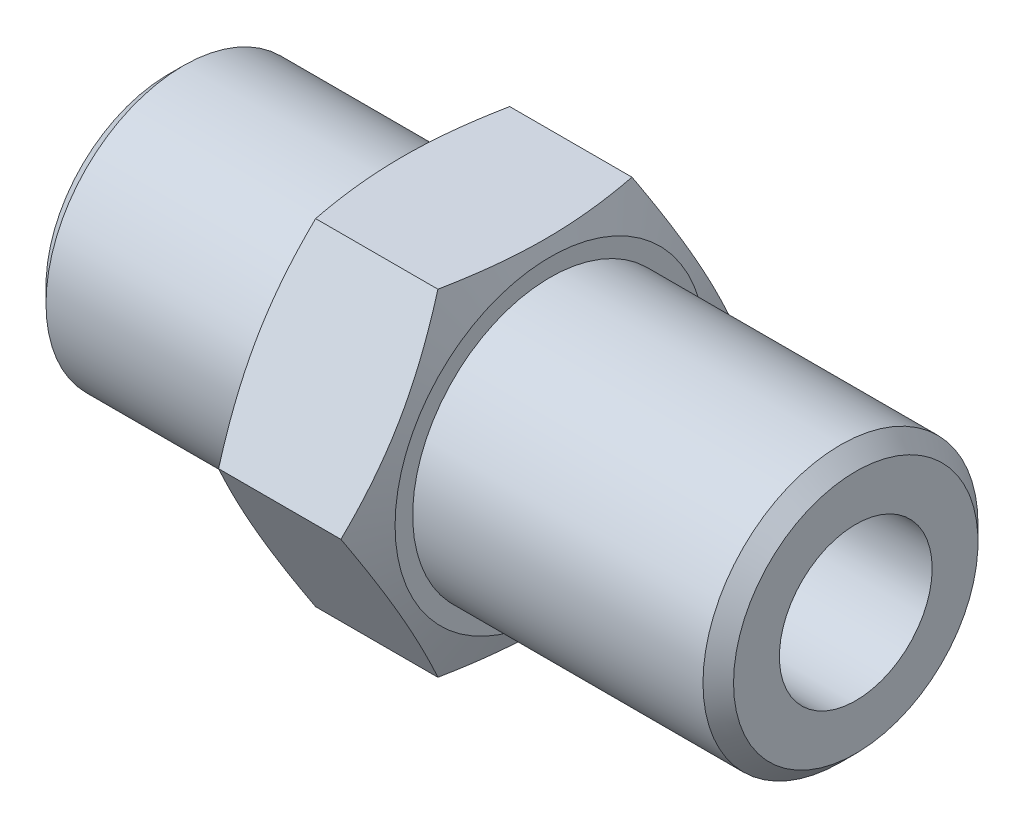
ISO-10303-21;
HEADER;
FILE_DESCRIPTION(('STEP AP214'),'2;1');
FILE_NAME('part.step','',(''),(''),'','','');
FILE_SCHEMA(('AUTOMOTIVE_DESIGN { 1 0 10303 214 1 1 1 1 }'));
ENDSEC;
DATA;
#1=APPLICATION_CONTEXT('core data for automotive mechanical design processes');
#2=APPLICATION_PROTOCOL_DEFINITION('international standard','automotive_design',2000,#1);
#3=PRODUCT_CONTEXT('',#1,'mechanical');
#4=PRODUCT('Part','Part','',(#3));
#5=PRODUCT_RELATED_PRODUCT_CATEGORY('part','',(#4));
#6=PRODUCT_DEFINITION_FORMATION('','',#4);
#7=PRODUCT_DEFINITION_CONTEXT('part definition',#1,'design');
#8=PRODUCT_DEFINITION('design','',#6,#7);
#9=PRODUCT_DEFINITION_SHAPE('','',#8);
#10=(LENGTH_UNIT() NAMED_UNIT(*) SI_UNIT(.MILLI.,.METRE.));
#11=(NAMED_UNIT(*) PLANE_ANGLE_UNIT() SI_UNIT($,.RADIAN.));
#12=(NAMED_UNIT(*) SI_UNIT($,.STERADIAN.) SOLID_ANGLE_UNIT());
#13=UNCERTAINTY_MEASURE_WITH_UNIT(LENGTH_MEASURE(1.E-05),#10,'distance_accuracy_value','');
#14=(GEOMETRIC_REPRESENTATION_CONTEXT(3) GLOBAL_UNCERTAINTY_ASSIGNED_CONTEXT((#13)) GLOBAL_UNIT_ASSIGNED_CONTEXT((#10,
#11,#12)) REPRESENTATION_CONTEXT('',''));
#15=CARTESIAN_POINT('',(0.,0.,0.));
#16=DIRECTION('',(0.,0.,1.));
#17=DIRECTION('',(1.,0.,0.));
#18=AXIS2_PLACEMENT_3D('',#15,#16,#17);
#19=CARTESIAN_POINT('',(-15.,0.,0.));
#20=DIRECTION('',(-1.,0.,0.));
#21=DIRECTION('',(0.,0.,1.));
#22=AXIS2_PLACEMENT_3D('',#19,#20,#21);
#23=PLANE('',#22);
#24=CARTESIAN_POINT('',(-15.,0.,0.));
#25=DIRECTION('',(-1.,0.,0.));
#26=DIRECTION('',(0.,0.,1.));
#27=AXIS2_PLACEMENT_3D('',#24,#25,#26);
#28=CIRCLE('',#27,5.);
#29=CARTESIAN_POINT('',(-15.,0.,5.));
#30=VERTEX_POINT('',#29);
#31=EDGE_CURVE('E19',#30,#30,#28,.F.);
#32=ORIENTED_EDGE('',*,*,#31,.T.);
#33=EDGE_LOOP('',(#32));
#34=FACE_BOUND('',#33,.T.);
#35=CARTESIAN_POINT('',(-15.,0.,0.));
#36=DIRECTION('',(1.,0.,0.));
#37=DIRECTION('',(0.,0.,-1.));
#38=AXIS2_PLACEMENT_3D('',#35,#36,#37);
#39=CIRCLE('',#38,8.);
#40=CARTESIAN_POINT('',(-15.,0.,-8.));
#41=VERTEX_POINT('',#40);
#42=EDGE_CURVE('E409',#41,#41,#39,.T.);
#43=ORIENTED_EDGE('',*,*,#42,.F.);
#44=EDGE_LOOP('',(#43));
#45=FACE_BOUND('',#44,.T.);
#46=ADVANCED_FACE('F16',(#34,#45),#23,.T.);
#47=CARTESIAN_POINT('',(0.,0.,0.));
#48=DIRECTION('',(-1.,0.,0.));
#49=DIRECTION('',(0.,0.,1.));
#50=AXIS2_PLACEMENT_3D('',#47,#48,#49);
#51=CYLINDRICAL_SURFACE('',#50,5.);
#52=ORIENTED_EDGE('',*,*,#31,.F.);
#53=EDGE_LOOP('',(#52));
#54=FACE_BOUND('',#53,.T.);
#55=CARTESIAN_POINT('',(0.,0.,0.));
#56=DIRECTION('',(-1.,0.,0.));
#57=DIRECTION('',(0.,0.,1.));
#58=AXIS2_PLACEMENT_3D('',#55,#56,#57);
#59=CIRCLE('',#58,5.);
#60=CARTESIAN_POINT('',(0.,0.,5.));
#61=VERTEX_POINT('',#60);
#62=EDGE_CURVE('E201',#61,#61,#59,.F.);
#63=ORIENTED_EDGE('',*,*,#62,.T.);
#64=EDGE_LOOP('',(#63));
#65=FACE_BOUND('',#64,.T.);
#66=ADVANCED_FACE('F381',(#54,#65),#51,.F.);
#67=CARTESIAN_POINT('',(-14.,0.,0.));
#68=DIRECTION('',(1.,0.,0.));
#69=DIRECTION('',(0.,0.,-1.));
#70=AXIS2_PLACEMENT_3D('',#67,#68,#69);
#71=CONICAL_SURFACE('',#70,9.,0.785398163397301);
#72=CARTESIAN_POINT('',(-14.,0.,0.));
#73=DIRECTION('',(-1.,0.,0.));
#74=DIRECTION('',(0.,0.,1.));
#75=AXIS2_PLACEMENT_3D('',#72,#73,#74);
#76=CIRCLE('',#75,9.);
#77=CARTESIAN_POINT('',(-14.,0.,9.));
#78=VERTEX_POINT('',#77);
#79=EDGE_CURVE('E197',#78,#78,#76,.F.);
#80=ORIENTED_EDGE('',*,*,#79,.F.);
#81=EDGE_LOOP('',(#80));
#82=FACE_BOUND('',#81,.T.);
#83=ORIENTED_EDGE('',*,*,#42,.T.);
#84=EDGE_LOOP('',(#83));
#85=FACE_BOUND('',#84,.T.);
#86=ADVANCED_FACE('F371',(#82,#85),#71,.T.);
#87=CARTESIAN_POINT('',(0.,0.,0.));
#88=DIRECTION('',(1.,0.,0.));
#89=DIRECTION('',(0.,0.,-1.));
#90=AXIS2_PLACEMENT_3D('',#87,#88,#89);
#91=PLANE('',#90);
#92=CARTESIAN_POINT('',(0.,0.,0.));
#93=DIRECTION('',(1.,0.,0.));
#94=DIRECTION('',(0.,0.,-1.));
#95=AXIS2_PLACEMENT_3D('',#92,#93,#94);
#96=CIRCLE('',#95,4.);
#97=CARTESIAN_POINT('',(0.,0.,-4.));
#98=VERTEX_POINT('',#97);
#99=EDGE_CURVE('E200',#98,#98,#96,.T.);
#100=ORIENTED_EDGE('',*,*,#99,.T.);
#101=EDGE_LOOP('',(#100));
#102=FACE_BOUND('',#101,.T.);
#103=ORIENTED_EDGE('',*,*,#62,.F.);
#104=EDGE_LOOP('',(#103));
#105=FACE_BOUND('',#104,.T.);
#106=ADVANCED_FACE('F361',(#102,#105),#91,.F.);
#107=CARTESIAN_POINT('',(0.,0.,0.));
#108=DIRECTION('',(-1.,0.,0.));
#109=DIRECTION('',(0.,0.,1.));
#110=AXIS2_PLACEMENT_3D('',#107,#108,#109);
#111=CYLINDRICAL_SURFACE('',#110,9.);
#112=ORIENTED_EDGE('',*,*,#79,.T.);
#113=EDGE_LOOP('',(#112));
#114=FACE_BOUND('',#113,.T.);
#115=CARTESIAN_POINT('',(0.,0.,0.));
#116=DIRECTION('',(-1.,0.,0.));
#117=DIRECTION('',(0.,0.,1.));
#118=AXIS2_PLACEMENT_3D('',#115,#116,#117);
#119=CIRCLE('',#118,9.);
#120=CARTESIAN_POINT('',(0.,0.,9.));
#121=VERTEX_POINT('',#120);
#122=EDGE_CURVE('E416',#121,#121,#119,.T.);
#123=ORIENTED_EDGE('',*,*,#122,.T.);
#124=EDGE_LOOP('',(#123));
#125=FACE_BOUND('',#124,.T.);
#126=ADVANCED_FACE('F351',(#114,#125),#111,.T.);
#127=CARTESIAN_POINT('',(0.,0.,0.));
#128=DIRECTION('',(1.,0.,0.));
#129=DIRECTION('',(0.,0.,-1.));
#130=AXIS2_PLACEMENT_3D('',#127,#128,#129);
#131=CYLINDRICAL_SURFACE('',#130,4.);
#132=CARTESIAN_POINT('',(10.,0.,0.));
#133=DIRECTION('',(1.,0.,0.));
#134=DIRECTION('',(0.,0.,-1.));
#135=AXIS2_PLACEMENT_3D('',#132,#133,#134);
#136=CIRCLE('',#135,4.);
#137=CARTESIAN_POINT('',(10.,0.,-4.));
#138=VERTEX_POINT('',#137);
#139=EDGE_CURVE('E419',#138,#138,#136,.F.);
#140=ORIENTED_EDGE('',*,*,#139,.F.);
#141=EDGE_LOOP('',(#140));
#142=FACE_BOUND('',#141,.T.);
#143=ORIENTED_EDGE('',*,*,#99,.F.);
#144=EDGE_LOOP('',(#143));
#145=FACE_BOUND('',#144,.T.);
#146=ADVANCED_FACE('F342',(#142,#145),#131,.F.);
#147=CARTESIAN_POINT('',(0.,0.,0.));
#148=DIRECTION('',(1.,0.,0.));
#149=DIRECTION('',(0.,0.,-1.));
#150=AXIS2_PLACEMENT_3D('',#147,#148,#149);
#151=PLANE('',#150);
#152=ORIENTED_EDGE('',*,*,#122,.F.);
#153=EDGE_LOOP('',(#152));
#154=FACE_BOUND('',#153,.T.);
#155=CARTESIAN_POINT('',(5.62700927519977E-13,0.,0.));
#156=DIRECTION('',(1.,0.,0.));
#157=DIRECTION('',(0.,0.,-1.));
#158=AXIS2_PLACEMENT_3D('',#155,#156,#157);
#159=CIRCLE('',#158,10.1536396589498);
#160=CARTESIAN_POINT('',(5.62700927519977E-13,0.,-10.1536396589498));
#161=VERTEX_POINT('',#160);
#162=EDGE_CURVE('E421',#161,#161,#159,.T.);
#163=ORIENTED_EDGE('',*,*,#162,.F.);
#164=EDGE_LOOP('',(#163));
#165=FACE_BOUND('',#164,.T.);
#166=ADVANCED_FACE('F333',(#154,#165),#151,.F.);
#167=CARTESIAN_POINT('',(10.,0.,0.));
#168=DIRECTION('',(1.,0.,0.));
#169=DIRECTION('',(0.,0.,-1.));
#170=AXIS2_PLACEMENT_3D('',#167,#168,#169);
#171=PLANE('',#170);
#172=ORIENTED_EDGE('',*,*,#139,.T.);
#173=EDGE_LOOP('',(#172));
#174=FACE_BOUND('',#173,.T.);
#175=CARTESIAN_POINT('',(10.,0.,0.));
#176=DIRECTION('',(1.,0.,0.));
#177=DIRECTION('',(0.,0.,-1.));
#178=AXIS2_PLACEMENT_3D('',#175,#176,#177);
#179=CIRCLE('',#178,5.);
#180=CARTESIAN_POINT('',(10.,0.,-5.));
#181=VERTEX_POINT('',#180);
#182=EDGE_CURVE('E73',#181,#181,#179,.T.);
#183=ORIENTED_EDGE('',*,*,#182,.T.);
#184=EDGE_LOOP('',(#183));
#185=FACE_BOUND('',#184,.T.);
#186=ADVANCED_FACE('F109',(#174,#185),#171,.T.);
#187=CARTESIAN_POINT('',(1.0034910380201,0.,0.));
#188=DIRECTION('',(1.,0.,0.));
#189=DIRECTION('',(0.,0.,-1.));
#190=AXIS2_PLACEMENT_3D('',#187,#188,#189);
#191=CONICAL_SURFACE('',#190,12.7169943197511,1.19766002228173);
#192=CARTESIAN_POINT('',(0.997506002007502,-6.70875652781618E-13,-12.7017059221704));
#193=CARTESIAN_POINT('',(0.907838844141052,0.396687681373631,-12.4726781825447));
#194=CARTESIAN_POINT('',(0.825166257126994,0.794653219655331,-12.2429126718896));
#195=CARTESIAN_POINT('',(0.676498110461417,1.59314113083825,-11.7819054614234));
#196=CARTESIAN_POINT('',(0.61051243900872,1.99366487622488,-11.5506629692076));
#197=CARTESIAN_POINT('',(0.498051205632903,2.79656722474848,-11.0871070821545));
#198=CARTESIAN_POINT('',(0.451564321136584,3.19894461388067,-10.8547943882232));
#199=CARTESIAN_POINT('',(0.380369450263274,4.00507249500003,-10.3893762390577));
#200=CARTESIAN_POINT('',(0.355656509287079,4.40882265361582,-10.1562709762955));
#201=CARTESIAN_POINT('',(0.329591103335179,5.21035151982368,-9.69350806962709));
#202=CARTESIAN_POINT('',(0.327866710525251,5.6081210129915,-9.46385574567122));
#203=CARTESIAN_POINT('',(0.346918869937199,6.40328744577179,-9.00476619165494));
#204=CARTESIAN_POINT('',(0.367697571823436,6.80068434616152,-8.77532898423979));
#205=CARTESIAN_POINT('',(0.430596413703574,7.59395489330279,-8.31733402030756));
#206=CARTESIAN_POINT('',(0.472704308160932,7.98982928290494,-8.08877583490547));
#207=CARTESIAN_POINT('',(0.576171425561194,8.77963113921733,-7.63278352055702));
#208=CARTESIAN_POINT('',(0.637528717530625,9.17355879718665,-7.40534928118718));
#209=CARTESIAN_POINT('',(0.728481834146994,9.68608582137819,-7.10944166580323));
#210=CARTESIAN_POINT('',(0.750508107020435,9.80572754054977,-7.04036648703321));
#211=CARTESIAN_POINT('',(0.796034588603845,10.0447845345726,-6.90234686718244));
#212=CARTESIAN_POINT('',(0.819534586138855,10.1641998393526,-6.83340240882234));
#213=CARTESIAN_POINT('',(0.868001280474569,10.403131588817,-6.69545509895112));
#214=CARTESIAN_POINT('',(0.89297168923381,10.5226474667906,-6.62645257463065));
#215=CARTESIAN_POINT('',(0.944252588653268,10.7614781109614,-6.48856363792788));
#216=CARTESIAN_POINT('',(0.970563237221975,10.8807928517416,-6.41967724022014));
#217=CARTESIAN_POINT('',(0.99750600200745,10.9999999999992,-6.35085296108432));
#218=B_SPLINE_CURVE_WITH_KNOTS('',3,(#192,#193,#194,#195,#196,#197,#198,#199,#200,#201,#202,
#203,#204,#205,#206,#207,#208,#209,#210,#211,#212,#213,#214,#215,#216,#217),.UNSPECIFIED.,.F.,
.F.,(4,2,2,2,2,2,2,2,2,2,2,2,4),(0.,1.40035072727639,2.80152932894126,4.20189316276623,
5.60193826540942,6.97930426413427,8.35680185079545,9.73350948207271,11.1100790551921,
11.529761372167,11.9493836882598,12.3701149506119,12.7908958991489),.UNSPECIFIED.);
#219=CARTESIAN_POINT('',(0.99750600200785,-3.36215534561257E-13,-12.7017059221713));
#220=VERTEX_POINT('',#219);
#221=CARTESIAN_POINT('',(0.997506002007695,10.9999999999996,-6.35085296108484));
#222=VERTEX_POINT('',#221);
#223=EDGE_CURVE('E62',#220,#222,#218,.T.);
#224=ORIENTED_EDGE('',*,*,#223,.F.);
#225=CARTESIAN_POINT('',(0.997506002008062,-11.,-6.35085296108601));
#226=CARTESIAN_POINT('',(0.907838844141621,-10.6033123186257,-6.5798807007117));
#227=CARTESIAN_POINT('',(0.825166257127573,-10.2053467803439,-6.80964621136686));
#228=CARTESIAN_POINT('',(0.676498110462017,-9.40685886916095,-7.27065342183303));
#229=CARTESIAN_POINT('',(0.610512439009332,-9.00633512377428,-7.50189591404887));
#230=CARTESIAN_POINT('',(0.498051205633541,-8.20343277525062,-7.96545180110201));
#231=CARTESIAN_POINT('',(0.451564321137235,-7.80105538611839,-8.19776449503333));
#232=CARTESIAN_POINT('',(0.380369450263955,-6.99492750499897,-8.66318264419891));
#233=CARTESIAN_POINT('',(0.355656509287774,-6.59117734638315,-8.89628790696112));
#234=CARTESIAN_POINT('',(0.329591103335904,-5.78964848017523,-9.35905081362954));
#235=CARTESIAN_POINT('',(0.327866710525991,-5.39187898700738,-9.58870313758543));
#236=CARTESIAN_POINT('',(0.346918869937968,-4.59671255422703,-10.0477926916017));
#237=CARTESIAN_POINT('',(0.367697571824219,-4.19931565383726,-10.2772298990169));
#238=CARTESIAN_POINT('',(0.430596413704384,-3.40604510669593,-10.7352248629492));
#239=CARTESIAN_POINT('',(0.472704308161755,-3.01017071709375,-10.9637830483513));
#240=CARTESIAN_POINT('',(0.576171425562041,-2.22036886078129,-11.4197753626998));
#241=CARTESIAN_POINT('',(0.637528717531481,-1.82644120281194,-11.6472096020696));
#242=CARTESIAN_POINT('',(0.728481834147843,-1.3139141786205,-11.9431172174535));
#243=CARTESIAN_POINT('',(0.750508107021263,-1.19427245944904,-12.0121923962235));
#244=CARTESIAN_POINT('',(0.796034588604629,-0.955215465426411,-12.1502120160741));
#245=CARTESIAN_POINT('',(0.819534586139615,-0.835800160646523,-12.2191564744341));
#246=CARTESIAN_POINT('',(0.868001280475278,-0.596868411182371,-12.3571037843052));
#247=CARTESIAN_POINT('',(0.892971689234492,-0.477352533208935,-12.4261063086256));
#248=CARTESIAN_POINT('',(0.944252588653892,-0.238521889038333,-12.5639952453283));
#249=CARTESIAN_POINT('',(0.970563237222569,-0.119207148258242,-12.6328816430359));
#250=CARTESIAN_POINT('',(0.997506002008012,-8.24101746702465E-13,-12.7017059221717));
#251=B_SPLINE_CURVE_WITH_KNOTS('',3,(#225,#226,#227,#228,#229,#230,#231,#232,#233,#234,#235,
#236,#237,#238,#239,#240,#241,#242,#243,#244,#245,#246,#247,#248,#249,#250),.UNSPECIFIED.,.F.,
.F.,(4,2,2,2,2,2,2,2,2,2,2,2,4),(0.,1.40035072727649,2.80152932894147,4.20189316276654,
5.60193826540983,6.97930426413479,8.35680185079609,9.73350948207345,11.1100790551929,
11.5297613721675,11.9493836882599,12.3701149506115,12.7908958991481),.UNSPECIFIED.);
#252=CARTESIAN_POINT('',(0.997506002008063,-11.,-6.350852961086));
#253=VERTEX_POINT('',#252);
#254=EDGE_CURVE('E67',#253,#220,#251,.T.);
#255=ORIENTED_EDGE('',*,*,#254,.F.);
#256=CARTESIAN_POINT('',(0.99750600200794,-11.,6.35085296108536));
#257=CARTESIAN_POINT('',(0.907838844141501,-11.,5.892797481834));
#258=CARTESIAN_POINT('',(0.825166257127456,-11.,5.43326646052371));
#259=CARTESIAN_POINT('',(0.676498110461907,-11.,4.51125203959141));
#260=CARTESIAN_POINT('',(0.610512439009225,-11.,4.04876705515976));
#261=CARTESIAN_POINT('',(0.49805120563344,-11.,3.12165528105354));
#262=CARTESIAN_POINT('',(0.451564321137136,-11.,2.65702989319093));
#263=CARTESIAN_POINT('',(0.38036945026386,-11.,1.72619359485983));
#264=CARTESIAN_POINT('',(0.355656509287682,-11.,1.25998306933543));
#265=CARTESIAN_POINT('',(0.329591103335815,-11.,0.334457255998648));
#266=CARTESIAN_POINT('',(0.327866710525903,-11.,-0.124847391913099));
#267=CARTESIAN_POINT('',(0.346918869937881,-11.,-1.04302649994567));
#268=CARTESIAN_POINT('',(0.367697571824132,-11.,-1.50190091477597));
#269=CARTESIAN_POINT('',(0.430596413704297,-11.,-2.41789084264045));
#270=CARTESIAN_POINT('',(0.472704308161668,-11.,-2.87500721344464));
#271=CARTESIAN_POINT('',(0.576171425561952,-11.,-3.78699184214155));
#272=CARTESIAN_POINT('',(0.637528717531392,-11.,-4.24186032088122));
#273=CARTESIAN_POINT('',(0.728481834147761,-11.,-4.83367555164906));
#274=CARTESIAN_POINT('',(0.750508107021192,-11.,-4.97182590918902));
#275=CARTESIAN_POINT('',(0.796034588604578,-11.,-5.2478651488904));
#276=CARTESIAN_POINT('',(0.819534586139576,-11.,-5.38575406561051));
#277=CARTESIAN_POINT('',(0.868001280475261,-11.,-5.66164868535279));
#278=CARTESIAN_POINT('',(0.892971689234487,-11.,-5.79965373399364));
#279=CARTESIAN_POINT('',(0.944252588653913,-11.,-6.07543160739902));
#280=CARTESIAN_POINT('',(0.970563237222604,-11.,-6.21320440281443));
#281=CARTESIAN_POINT('',(0.997506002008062,-11.,-6.35085296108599));
#282=B_SPLINE_CURVE_WITH_KNOTS('',3,(#256,#257,#258,#259,#260,#261,#262,#263,#264,#265,#266,
#267,#268,#269,#270,#271,#272,#273,#274,#275,#276,#277,#278,#279,#280,#281),.UNSPECIFIED.,.F.,
.F.,(4,2,2,2,2,2,2,2,2,2,2,2,4),(0.,1.40035072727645,2.80152932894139,4.20189316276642,
5.60193826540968,6.9793042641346,8.35680185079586,9.73350948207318,11.1100790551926,
11.5297613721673,11.9493836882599,12.3701149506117,12.7908958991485),.UNSPECIFIED.);
#283=CARTESIAN_POINT('',(0.997506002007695,-10.9999999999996,6.35085296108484));
#284=VERTEX_POINT('',#283);
#285=EDGE_CURVE('E85',#284,#253,#282,.T.);
#286=ORIENTED_EDGE('',*,*,#285,.F.);
#287=CARTESIAN_POINT('',(0.997506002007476,5.5778416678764E-13,12.7017059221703));
#288=CARTESIAN_POINT('',(0.907838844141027,-0.396687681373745,12.4726781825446));
#289=CARTESIAN_POINT('',(0.825166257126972,-0.794653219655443,12.2429126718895));
#290=CARTESIAN_POINT('',(0.676498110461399,-1.59314113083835,11.7819054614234));
#291=CARTESIAN_POINT('',(0.610512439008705,-1.99366487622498,11.5506629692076));
#292=CARTESIAN_POINT('',(0.498051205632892,-2.79656722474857,11.0871070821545));
#293=CARTESIAN_POINT('',(0.451564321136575,-3.19894461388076,10.8547943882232));
#294=CARTESIAN_POINT('',(0.380369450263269,-4.00507249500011,10.3893762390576));
#295=CARTESIAN_POINT('',(0.355656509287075,-4.4088226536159,10.1562709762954));
#296=CARTESIAN_POINT('',(0.329591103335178,-5.21035151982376,9.69350806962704));
#297=CARTESIAN_POINT('',(0.327866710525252,-5.60812101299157,9.46385574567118));
#298=CARTESIAN_POINT('',(0.346918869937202,-6.40328744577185,9.0047661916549));
#299=CARTESIAN_POINT('',(0.36769757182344,-6.80068434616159,8.77532898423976));
#300=CARTESIAN_POINT('',(0.43059641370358,-7.59395489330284,8.31733402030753));
#301=CARTESIAN_POINT('',(0.472704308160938,-7.989829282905,8.08877583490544));
#302=CARTESIAN_POINT('',(0.5761714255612,-8.77963113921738,7.632783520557));
#303=CARTESIAN_POINT('',(0.63752871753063,-9.1735587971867,7.40534928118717));
#304=CARTESIAN_POINT('',(0.728481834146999,-9.68608582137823,7.10944166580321));
#305=CARTESIAN_POINT('',(0.750508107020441,-9.8057275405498,7.04036648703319));
#306=CARTESIAN_POINT('',(0.79603458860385,-10.0447845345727,6.90234686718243));
#307=CARTESIAN_POINT('',(0.819534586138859,-10.1641998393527,6.83340240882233));
#308=CARTESIAN_POINT('',(0.868001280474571,-10.403131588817,6.69545509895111));
#309=CARTESIAN_POINT('',(0.892971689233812,-10.5226474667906,6.62645257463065));
#310=CARTESIAN_POINT('',(0.944252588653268,-10.7614781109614,6.48856363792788));
#311=CARTESIAN_POINT('',(0.970563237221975,-10.8807928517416,6.41967724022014));
#312=CARTESIAN_POINT('',(0.99750600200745,-10.9999999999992,6.35085296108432));
#313=B_SPLINE_CURVE_WITH_KNOTS('',3,(#287,#288,#289,#290,#291,#292,#293,#294,#295,#296,#297,
#298,#299,#300,#301,#302,#303,#304,#305,#306,#307,#308,#309,#310,#311,#312),.UNSPECIFIED.,.F.,
.F.,(4,2,2,2,2,2,2,2,2,2,2,2,4),(0.,1.40035072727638,2.80152932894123,4.20189316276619,
5.60193826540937,6.9793042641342,8.35680185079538,9.73350948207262,11.110079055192,
11.5297613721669,11.9493836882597,12.3701149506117,12.7908958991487),.UNSPECIFIED.);
#314=CARTESIAN_POINT('',(0.997506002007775,0.,12.7017059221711));
#315=VERTEX_POINT('',#314);
#316=EDGE_CURVE('E114',#315,#284,#313,.T.);
#317=ORIENTED_EDGE('',*,*,#316,.F.);
#318=CARTESIAN_POINT('',(0.997506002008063,11.,6.35085296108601));
#319=CARTESIAN_POINT('',(0.907838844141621,10.6033123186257,6.5798807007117));
#320=CARTESIAN_POINT('',(0.825166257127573,10.2053467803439,6.80964621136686));
#321=CARTESIAN_POINT('',(0.676498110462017,9.40685886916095,7.27065342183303));
#322=CARTESIAN_POINT('',(0.610512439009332,9.00633512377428,7.50189591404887));
#323=CARTESIAN_POINT('',(0.498051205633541,8.20343277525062,7.96545180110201));
#324=CARTESIAN_POINT('',(0.451564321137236,7.8010553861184,8.19776449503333));
#325=CARTESIAN_POINT('',(0.380369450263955,6.99492750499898,8.66318264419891));
#326=CARTESIAN_POINT('',(0.355656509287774,6.59117734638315,8.89628790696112));
#327=CARTESIAN_POINT('',(0.329591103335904,5.78964848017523,9.35905081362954));
#328=CARTESIAN_POINT('',(0.327866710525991,5.39187898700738,9.58870313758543));
#329=CARTESIAN_POINT('',(0.346918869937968,4.59671255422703,10.0477926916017));
#330=CARTESIAN_POINT('',(0.367697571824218,4.19931565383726,10.2772298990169));
#331=CARTESIAN_POINT('',(0.430596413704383,3.40604510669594,10.7352248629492));
#332=CARTESIAN_POINT('',(0.472704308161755,3.01017071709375,10.9637830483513));
#333=CARTESIAN_POINT('',(0.57617142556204,2.2203688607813,11.4197753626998));
#334=CARTESIAN_POINT('',(0.63752871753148,1.82644120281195,11.6472096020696));
#335=CARTESIAN_POINT('',(0.72848183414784,1.31391417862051,11.9431172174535));
#336=CARTESIAN_POINT('',(0.750508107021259,1.19427245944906,12.0121923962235));
#337=CARTESIAN_POINT('',(0.796034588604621,0.955215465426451,12.1502120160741));
#338=CARTESIAN_POINT('',(0.819534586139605,0.835800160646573,12.2191564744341));
#339=CARTESIAN_POINT('',(0.868001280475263,0.596868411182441,12.3571037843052));
#340=CARTESIAN_POINT('',(0.892971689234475,0.477352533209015,12.4261063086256));
#341=CARTESIAN_POINT('',(0.944252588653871,0.238521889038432,12.5639952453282));
#342=CARTESIAN_POINT('',(0.970563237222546,0.119207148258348,12.6328816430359));
#343=CARTESIAN_POINT('',(0.997506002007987,9.35921459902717E-13,12.7017059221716));
#344=B_SPLINE_CURVE_WITH_KNOTS('',3,(#318,#319,#320,#321,#322,#323,#324,#325,#326,#327,#328,
#329,#330,#331,#332,#333,#334,#335,#336,#337,#338,#339,#340,#341,#342,#343),.UNSPECIFIED.,.F.,
.F.,(4,2,2,2,2,2,2,2,2,2,2,2,4),(0.,1.40035072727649,2.80152932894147,4.20189316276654,
5.60193826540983,6.97930426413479,8.35680185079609,9.73350948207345,11.1100790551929,
11.5297613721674,11.9493836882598,12.3701149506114,12.7908958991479),.UNSPECIFIED.);
#345=CARTESIAN_POINT('',(0.997506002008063,11.,6.350852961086));
#346=VERTEX_POINT('',#345);
#347=EDGE_CURVE('E123',#346,#315,#344,.T.);
#348=ORIENTED_EDGE('',*,*,#347,.F.);
#349=CARTESIAN_POINT('',(0.99750600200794,11.,-6.35085296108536));
#350=CARTESIAN_POINT('',(0.907838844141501,11.,-5.892797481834));
#351=CARTESIAN_POINT('',(0.825166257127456,11.,-5.43326646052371));
#352=CARTESIAN_POINT('',(0.676498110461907,11.,-4.51125203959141));
#353=CARTESIAN_POINT('',(0.610512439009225,11.,-4.04876705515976));
#354=CARTESIAN_POINT('',(0.49805120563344,11.,-3.12165528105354));
#355=CARTESIAN_POINT('',(0.451564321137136,11.,-2.65702989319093));
#356=CARTESIAN_POINT('',(0.38036945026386,11.,-1.72619359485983));
#357=CARTESIAN_POINT('',(0.355656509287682,11.,-1.25998306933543));
#358=CARTESIAN_POINT('',(0.329591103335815,11.,-0.334457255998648));
#359=CARTESIAN_POINT('',(0.327866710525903,11.,0.124847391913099));
#360=CARTESIAN_POINT('',(0.346918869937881,11.,1.04302649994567));
#361=CARTESIAN_POINT('',(0.367697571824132,11.,1.50190091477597));
#362=CARTESIAN_POINT('',(0.430596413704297,11.,2.41789084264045));
#363=CARTESIAN_POINT('',(0.472704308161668,11.,2.87500721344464));
#364=CARTESIAN_POINT('',(0.576171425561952,11.,3.78699184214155));
#365=CARTESIAN_POINT('',(0.637528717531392,11.,4.24186032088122));
#366=CARTESIAN_POINT('',(0.728481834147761,11.,4.83367555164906));
#367=CARTESIAN_POINT('',(0.750508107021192,11.,4.97182590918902));
#368=CARTESIAN_POINT('',(0.796034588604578,11.,5.2478651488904));
#369=CARTESIAN_POINT('',(0.819534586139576,11.,5.38575406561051));
#370=CARTESIAN_POINT('',(0.868001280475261,11.,5.66164868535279));
#371=CARTESIAN_POINT('',(0.892971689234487,11.,5.79965373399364));
#372=CARTESIAN_POINT('',(0.944252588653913,11.,6.07543160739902));
#373=CARTESIAN_POINT('',(0.970563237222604,11.,6.21320440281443));
#374=CARTESIAN_POINT('',(0.997506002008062,11.,6.35085296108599));
#375=B_SPLINE_CURVE_WITH_KNOTS('',3,(#349,#350,#351,#352,#353,#354,#355,#356,#357,#358,#359,
#360,#361,#362,#363,#364,#365,#366,#367,#368,#369,#370,#371,#372,#373,#374),.UNSPECIFIED.,.F.,
.F.,(4,2,2,2,2,2,2,2,2,2,2,2,4),(0.,1.40035072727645,2.80152932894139,4.20189316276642,
5.60193826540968,6.9793042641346,8.35680185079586,9.73350948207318,11.1100790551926,
11.5297613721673,11.9493836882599,12.3701149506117,12.7908958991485),.UNSPECIFIED.);
#376=EDGE_CURVE('E70',#222,#346,#375,.T.);
#377=ORIENTED_EDGE('',*,*,#376,.F.);
#378=EDGE_LOOP('',(#224,#255,#286,#317,#348,#377));
#379=FACE_BOUND('',#378,.T.);
#380=ORIENTED_EDGE('',*,*,#162,.T.);
#381=EDGE_LOOP('',(#380));
#382=FACE_BOUND('',#381,.T.);
#383=ADVANCED_FACE('F63',(#379,#382),#191,.T.);
#384=CARTESIAN_POINT('',(10.,0.,0.));
#385=DIRECTION('',(1.,0.,0.));
#386=DIRECTION('',(0.,0.,-1.));
#387=AXIS2_PLACEMENT_3D('',#384,#385,#386);
#388=CYLINDRICAL_SURFACE('',#387,5.);
#389=CARTESIAN_POINT('',(30.,0.,0.));
#390=DIRECTION('',(1.,0.,0.));
#391=DIRECTION('',(0.,0.,-1.));
#392=AXIS2_PLACEMENT_3D('',#389,#390,#391);
#393=CIRCLE('',#392,5.);
#394=CARTESIAN_POINT('',(30.,0.,-5.));
#395=VERTEX_POINT('',#394);
#396=EDGE_CURVE('E80',#395,#395,#393,.F.);
#397=ORIENTED_EDGE('',*,*,#396,.F.);
#398=EDGE_LOOP('',(#397));
#399=FACE_BOUND('',#398,.T.);
#400=ORIENTED_EDGE('',*,*,#182,.F.);
#401=EDGE_LOOP('',(#400));
#402=FACE_BOUND('',#401,.T.);
#403=ADVANCED_FACE('F108',(#399,#402),#388,.F.);
#404=CARTESIAN_POINT('',(0.,0.,-12.70170592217));
#405=DIRECTION('',(0.,0.500000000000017,-0.866025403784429));
#406=DIRECTION('',(0.,0.866025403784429,0.500000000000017));
#407=AXIS2_PLACEMENT_3D('',#404,#405,#406);
#408=PLANE('',#407);
#409=DIRECTION('',(1.,0.,0.));
#410=VECTOR('',#409,1.);
#411=CARTESIAN_POINT('',(0.,11.,-6.350852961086));
#412=LINE('',#411,#410);
#413=CARTESIAN_POINT('',(9.00249399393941,11.,-6.35085298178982));
#414=VERTEX_POINT('',#413);
#415=EDGE_CURVE('E72',#414,#222,#412,.F.);
#416=ORIENTED_EDGE('',*,*,#415,.F.);
#417=CARTESIAN_POINT('',(9.00249399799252,-5.56506516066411E-13,-12.7017059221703));
#418=CARTESIAN_POINT('',(9.09216115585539,0.396687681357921,-12.4726781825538));
#419=CARTESIAN_POINT('',(9.17483374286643,0.794653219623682,-12.2429126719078));
#420=CARTESIAN_POINT('',(9.32350188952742,1.59314113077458,-11.7819054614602));
#421=CARTESIAN_POINT('',(9.38948756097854,1.99366487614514,-11.5506629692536));
#422=CARTESIAN_POINT('',(9.50194879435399,2.79656722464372,-11.087107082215));
#423=CARTESIAN_POINT('',(9.54843567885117,3.19894461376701,-10.8547943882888));
#424=CARTESIAN_POINT('',(9.61963054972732,4.00507249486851,-10.3893762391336));
#425=CARTESIAN_POINT('',(9.64434349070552,4.40882265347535,-10.1562709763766));
#426=CARTESIAN_POINT('',(9.67040889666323,5.21035151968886,-9.69350806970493));
#427=CARTESIAN_POINT('',(9.67213328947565,5.60812101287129,-9.46385574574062));
#428=CARTESIAN_POINT('',(9.65308113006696,6.40328744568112,-9.00476619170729));
#429=CARTESIAN_POINT('',(9.63230242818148,6.80068434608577,-8.77532898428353));
#430=CARTESIAN_POINT('',(9.56940358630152,7.59395489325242,-8.31733402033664));
#431=CARTESIAN_POINT('',(9.52729569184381,7.98982928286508,-8.08877583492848));
#432=CARTESIAN_POINT('',(9.42382857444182,8.77963113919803,-7.63278352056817));
#433=CARTESIAN_POINT('',(9.36247128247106,9.17355879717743,-7.40534928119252));
#434=CARTESIAN_POINT('',(9.27151816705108,9.68608581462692,-7.10944166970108));
#435=CARTESIAN_POINT('',(9.24949189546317,9.80572752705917,-7.04036649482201));
#436=CARTESIAN_POINT('',(9.2039654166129,10.0447845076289,-6.90234688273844));
#437=CARTESIAN_POINT('',(9.18046542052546,10.164199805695,-6.83340242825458));
#438=CARTESIAN_POINT('',(9.13199872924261,10.4031315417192,-6.69545512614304));
#439=CARTESIAN_POINT('',(9.10702832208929,10.5226474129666,-6.62645260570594));
#440=CARTESIAN_POINT('',(9.05574742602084,10.7614780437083,-6.48856367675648));
#441=CARTESIAN_POINT('',(9.02943677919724,10.8807927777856,-6.41967728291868));
#442=CARTESIAN_POINT('',(9.00249401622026,10.9999999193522,-6.35085300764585));
#443=B_SPLINE_CURVE_WITH_KNOTS('',3,(#417,#418,#419,#420,#421,#422,#423,#424,#425,#426,#427,
#428,#429,#430,#431,#432,#433,#434,#435,#436,#437,#438,#439,#440,#441,#442),.UNSPECIFIED.,.F.,
.F.,(4,2,2,2,2,2,2,2,2,2,2,2,4),(0.,1.40035072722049,2.80152932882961,4.20189316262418,
5.60193826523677,6.97930426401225,8.3568018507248,9.73350948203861,11.110079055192,
11.5297613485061,11.9493836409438,12.3701148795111,12.7908958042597),.UNSPECIFIED.);
#444=CARTESIAN_POINT('',(9.00249399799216,-2.78253220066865E-13,-12.7017059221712));
#445=VERTEX_POINT('',#444);
#446=EDGE_CURVE('E34',#445,#414,#443,.T.);
#447=ORIENTED_EDGE('',*,*,#446,.F.);
#448=DIRECTION('',(1.,0.,0.));
#449=VECTOR('',#448,1.);
#450=CARTESIAN_POINT('',(0.,-9.36750677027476E-13,-12.7017059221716));
#451=LINE('',#450,#449);
#452=EDGE_CURVE('E75',#220,#445,#451,.T.);
#453=ORIENTED_EDGE('',*,*,#452,.F.);
#454=ORIENTED_EDGE('',*,*,#223,.T.);
#455=EDGE_LOOP('',(#416,#447,#453,#454));
#456=FACE_BOUND('',#455,.T.);
#457=ADVANCED_FACE('F76',(#456),#408,.T.);
#458=CARTESIAN_POINT('',(0.,11.,-6.350852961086));
#459=DIRECTION('',(0.,1.,0.));
#460=DIRECTION('',(0.,0.,1.));
#461=AXIS2_PLACEMENT_3D('',#458,#459,#460);
#462=PLANE('',#461);
#463=DIRECTION('',(1.,0.,0.));
#464=VECTOR('',#463,1.);
#465=CARTESIAN_POINT('',(0.,11.,6.350852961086));
#466=LINE('',#465,#464);
#467=CARTESIAN_POINT('',(9.00249399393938,11.0000000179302,6.35085295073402));
#468=VERTEX_POINT('',#467);
#469=EDGE_CURVE('E203',#468,#346,#466,.F.);
#470=ORIENTED_EDGE('',*,*,#469,.F.);
#471=CARTESIAN_POINT('',(9.0024939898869,11.,-6.35085300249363));
#472=CARTESIAN_POINT('',(9.09216114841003,11.,-5.89279752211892));
#473=CARTESIAN_POINT('',(9.17483373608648,11.,-5.43326649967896));
#474=CARTESIAN_POINT('',(9.32350188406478,11.,-4.51125207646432));
#475=CARTESIAN_POINT('',(9.38948755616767,11.,-4.04876709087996));
#476=CARTESIAN_POINT('',(9.50194879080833,11.,-3.12165531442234));
#477=CARTESIAN_POINT('',(9.54843567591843,11.,-2.65702992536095));
#478=CARTESIAN_POINT('',(9.61963054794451,11.,-1.7261936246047));
#479=CARTESIAN_POINT('',(9.64434348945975,11.,-1.25998309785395));
#480=CARTESIAN_POINT('',(9.67040889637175,11.,-0.334457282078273));
#481=CARTESIAN_POINT('',(9.67213328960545,11.,0.124847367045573));
#482=CARTESIAN_POINT('',(9.65308113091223,11.,1.04302647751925));
#483=CARTESIAN_POINT('',(9.63230242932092,11.,1.50190089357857));
#484=CARTESIAN_POINT('',(9.5694035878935,11.,2.41789082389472));
#485=CARTESIAN_POINT('',(9.52729569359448,11.,2.87500719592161));
#486=CARTESIAN_POINT('',(9.42382857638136,11.,3.78699182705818));
#487=CARTESIAN_POINT('',(9.36247128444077,11.,4.24186030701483));
#488=CARTESIAN_POINT('',(9.2715181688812,11.,4.83367553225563));
#489=CARTESIAN_POINT('',(9.24949189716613,11.,4.97182588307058));
#490=CARTESIAN_POINT('',(9.20396541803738,11.,5.24786510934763));
#491=CARTESIAN_POINT('',(9.18046542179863,11.,5.38575401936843));
#492=CARTESIAN_POINT('',(9.13199873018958,11.,5.66164862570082));
#493=CARTESIAN_POINT('',(9.10702832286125,11.,5.7996536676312));
#494=CARTESIAN_POINT('',(9.05574742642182,11.,6.07543152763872));
#495=CARTESIAN_POINT('',(9.02943677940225,11.,6.21320431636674));
#496=CARTESIAN_POINT('',(9.00249401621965,11.,6.35085286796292));
#497=B_SPLINE_CURVE_WITH_KNOTS('',3,(#471,#472,#473,#474,#475,#476,#477,#478,#479,#480,#481,
#482,#483,#484,#485,#486,#487,#488,#489,#490,#491,#492,#493,#494,#495,#496),.UNSPECIFIED.,.F.,
.F.,(4,2,2,2,2,2,2,2,2,2,2,2,4),(0.,1.40035073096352,2.80152933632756,4.20189317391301,
5.60193828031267,6.97930428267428,8.35680187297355,9.73350950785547,11.1100790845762,
11.5297613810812,11.9493836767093,12.3701149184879,12.7908958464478),.UNSPECIFIED.);
#498=EDGE_CURVE('E153',#414,#468,#497,.T.);
#499=ORIENTED_EDGE('',*,*,#498,.F.);
#500=ORIENTED_EDGE('',*,*,#415,.T.);
#501=ORIENTED_EDGE('',*,*,#376,.T.);
#502=EDGE_LOOP('',(#470,#499,#500,#501));
#503=FACE_BOUND('',#502,.T.);
#504=ADVANCED_FACE('F144',(#503),#462,.T.);
#505=CARTESIAN_POINT('',(0.,11.,6.350852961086));
#506=DIRECTION('',(0.,0.500000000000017,0.866025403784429));
#507=DIRECTION('',(0.,-0.866025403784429,0.500000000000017));
#508=AXIS2_PLACEMENT_3D('',#505,#506,#507);
#509=PLANE('',#508);
#510=DIRECTION('',(1.,0.,0.));
#511=VECTOR('',#510,1.);
#512=CARTESIAN_POINT('',(0.,0.,12.70170592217));
#513=LINE('',#512,#511);
#514=CARTESIAN_POINT('',(9.00249399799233,4.67882566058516E-13,12.7017059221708));
#515=VERTEX_POINT('',#514);
#516=EDGE_CURVE('E206',#515,#315,#513,.F.);
#517=ORIENTED_EDGE('',*,*,#516,.F.);
#518=CARTESIAN_POINT('',(9.00249396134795,11.0000000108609,6.35085290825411));
#519=CARTESIAN_POINT('',(9.09216113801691,10.603312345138,6.57988066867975));
#520=CARTESIAN_POINT('',(9.17483373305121,10.2053468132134,6.80964618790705));
#521=CARTESIAN_POINT('',(9.32350188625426,9.40685890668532,7.27065340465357));
#522=CARTESIAN_POINT('',(9.38948755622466,9.00633515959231,7.50189589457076));
#523=CARTESIAN_POINT('',(9.50194878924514,8.20343281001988,7.96545177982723));
#524=CARTESIAN_POINT('',(9.54843567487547,7.80105542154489,8.19776447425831));
#525=CARTESIAN_POINT('',(9.61963054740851,6.99492754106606,8.66318262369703));
#526=CARTESIAN_POINT('',(9.64434348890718,6.5911773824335,8.89628788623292));
#527=CARTESIAN_POINT('',(9.67040889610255,5.7896485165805,9.35905079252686));
#528=CARTESIAN_POINT('',(9.67213328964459,5.39187902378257,9.58870311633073));
#529=CARTESIAN_POINT('',(9.65308113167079,4.59671259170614,10.0477926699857));
#530=CARTESIAN_POINT('',(9.6323024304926,4.19931569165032,10.2772298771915));
#531=CARTESIAN_POINT('',(9.56940359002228,3.40604514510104,10.73522484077));
#532=CARTESIAN_POINT('',(9.52729569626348,3.01017075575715,10.9637830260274));
#533=CARTESIAN_POINT('',(9.4238285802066,2.2203688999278,11.4197753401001));
#534=CARTESIAN_POINT('',(9.36247128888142,1.82644124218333,11.6472095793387));
#535=CARTESIAN_POINT('',(9.2715181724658,1.31391421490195,11.9431171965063));
#536=CARTESIAN_POINT('',(9.24949189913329,1.19427249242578,12.0121923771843));
#537=CARTESIAN_POINT('',(9.20396541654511,0.955215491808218,12.1502120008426));
#538=CARTESIAN_POINT('',(9.18046541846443,0.835800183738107,12.2191564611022));
#539=CARTESIAN_POINT('',(9.1319987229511,0.596868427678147,12.3571037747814));
#540=CARTESIAN_POINT('',(9.10702831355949,0.477352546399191,12.4261063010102));
#541=CARTESIAN_POINT('',(9.05574741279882,0.2385218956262,12.5639952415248));
#542=CARTESIAN_POINT('',(9.02943676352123,0.119207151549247,12.6328816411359));
#543=CARTESIAN_POINT('',(9.00249399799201,9.35766459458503E-13,12.7017059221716));
#544=B_SPLINE_CURVE_WITH_KNOTS('',3,(#518,#519,#520,#521,#522,#523,#524,#525,#526,#527,#528,
#529,#530,#531,#532,#533,#534,#535,#536,#537,#538,#539,#540,#541,#542,#543),.UNSPECIFIED.,.F.,
.F.,(4,2,2,2,2,2,2,2,2,2,2,2,4),(0.,1.40035072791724,2.80152932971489,4.20189316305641,
5.60193826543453,6.97930426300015,8.35680184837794,9.73350947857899,11.1100790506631,
11.5297613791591,11.9493837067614,12.370114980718,12.7908959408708),.UNSPECIFIED.);
#545=EDGE_CURVE('E179',#468,#515,#544,.T.);
#546=ORIENTED_EDGE('',*,*,#545,.F.);
#547=ORIENTED_EDGE('',*,*,#469,.T.);
#548=ORIENTED_EDGE('',*,*,#347,.T.);
#549=EDGE_LOOP('',(#517,#546,#547,#548));
#550=FACE_BOUND('',#549,.T.);
#551=ADVANCED_FACE('F289',(#550),#509,.T.);
#552=CARTESIAN_POINT('',(0.,0.,12.70170592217));
#553=DIRECTION('',(0.,-0.500000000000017,0.866025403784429));
#554=DIRECTION('',(0.,-0.866025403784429,-0.500000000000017));
#555=AXIS2_PLACEMENT_3D('',#552,#553,#554);
#556=PLANE('',#555);
#557=DIRECTION('',(1.,0.,0.));
#558=VECTOR('',#557,1.);
#559=CARTESIAN_POINT('',(0.,-11.,6.350852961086));
#560=LINE('',#559,#558);
#561=CARTESIAN_POINT('',(9.00249399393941,-11.,6.35085298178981));
#562=VERTEX_POINT('',#561);
#563=EDGE_CURVE('E209',#562,#284,#560,.F.);
#564=ORIENTED_EDGE('',*,*,#563,.F.);
#565=CARTESIAN_POINT('',(9.00249399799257,3.30689585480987E-13,12.7017059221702));
#566=CARTESIAN_POINT('',(9.09216115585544,-0.396687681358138,12.4726781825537));
#567=CARTESIAN_POINT('',(9.17483374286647,-0.794653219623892,12.2429126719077));
#568=CARTESIAN_POINT('',(9.32350188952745,-1.59314113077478,11.7819054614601));
#569=CARTESIAN_POINT('',(9.38948756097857,-1.99366487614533,11.5506629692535));
#570=CARTESIAN_POINT('',(9.50194879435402,-2.7965672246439,11.0871070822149));
#571=CARTESIAN_POINT('',(9.54843567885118,-3.19894461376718,10.8547943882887));
#572=CARTESIAN_POINT('',(9.61963054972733,-4.00507249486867,10.3893762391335));
#573=CARTESIAN_POINT('',(9.64434349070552,-4.40882265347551,10.1562709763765));
#574=CARTESIAN_POINT('',(9.67040889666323,-5.210351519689,9.69350806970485));
#575=CARTESIAN_POINT('',(9.67213328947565,-5.60812101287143,9.46385574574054));
#576=CARTESIAN_POINT('',(9.65308113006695,-6.40328744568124,9.00476619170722));
#577=CARTESIAN_POINT('',(9.63230242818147,-6.80068434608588,8.77532898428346));
#578=CARTESIAN_POINT('',(9.5694035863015,-7.59395489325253,8.31733402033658));
#579=CARTESIAN_POINT('',(9.52729569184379,-7.98982928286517,8.08877583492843));
#580=CARTESIAN_POINT('',(9.42382857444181,-8.77963113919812,7.63278352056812));
#581=CARTESIAN_POINT('',(9.36247128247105,-9.17355879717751,7.40534928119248));
#582=CARTESIAN_POINT('',(9.27151816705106,-9.68608581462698,7.10944166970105));
#583=CARTESIAN_POINT('',(9.24949189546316,-9.80572752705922,7.04036649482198));
#584=CARTESIAN_POINT('',(9.20396541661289,-10.0447845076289,6.90234688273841));
#585=CARTESIAN_POINT('',(9.18046542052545,-10.164199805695,6.83340242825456));
#586=CARTESIAN_POINT('',(9.13199872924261,-10.4031315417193,6.69545512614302));
#587=CARTESIAN_POINT('',(9.10702832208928,-10.5226474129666,6.62645260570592));
#588=CARTESIAN_POINT('',(9.05574742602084,-10.7614780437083,6.48856367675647));
#589=CARTESIAN_POINT('',(9.02943677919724,-10.8807927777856,6.41967728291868));
#590=CARTESIAN_POINT('',(9.00249401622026,-10.9999999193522,6.35085300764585));
#591=B_SPLINE_CURVE_WITH_KNOTS('',3,(#565,#566,#567,#568,#569,#570,#571,#572,#573,#574,#575,
#576,#577,#578,#579,#580,#581,#582,#583,#584,#585,#586,#587,#588,#589,#590),.UNSPECIFIED.,.F.,
.F.,(4,2,2,2,2,2,2,2,2,2,2,2,4),(0.,1.40035072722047,2.80152932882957,4.20189316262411,
5.60193826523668,6.97930426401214,8.35680185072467,9.73350948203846,11.1100790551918,
11.5297613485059,11.9493836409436,12.3701148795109,12.7908958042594),.UNSPECIFIED.);
#592=EDGE_CURVE('E448',#515,#562,#591,.T.);
#593=ORIENTED_EDGE('',*,*,#592,.F.);
#594=ORIENTED_EDGE('',*,*,#516,.T.);
#595=ORIENTED_EDGE('',*,*,#316,.T.);
#596=EDGE_LOOP('',(#564,#593,#594,#595));
#597=FACE_BOUND('',#596,.T.);
#598=ADVANCED_FACE('F280',(#597),#556,.T.);
#599=CARTESIAN_POINT('',(0.,-11.,6.350852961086));
#600=DIRECTION('',(0.,-1.,0.));
#601=DIRECTION('',(0.,0.,-1.));
#602=AXIS2_PLACEMENT_3D('',#599,#600,#601);
#603=PLANE('',#602);
#604=DIRECTION('',(1.,0.,0.));
#605=VECTOR('',#604,1.);
#606=CARTESIAN_POINT('',(0.,-11.,-6.350852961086));
#607=LINE('',#606,#605);
#608=CARTESIAN_POINT('',(9.00249399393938,-11.0000000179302,-6.35085295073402));
#609=VERTEX_POINT('',#608);
#610=EDGE_CURVE('E83',#609,#253,#607,.F.);
#611=ORIENTED_EDGE('',*,*,#610,.F.);
#612=CARTESIAN_POINT('',(9.0024939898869,-11.,6.35085300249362));
#613=CARTESIAN_POINT('',(9.09216114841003,-11.,5.89279752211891));
#614=CARTESIAN_POINT('',(9.17483373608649,-11.,5.43326649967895));
#615=CARTESIAN_POINT('',(9.32350188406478,-11.,4.51125207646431));
#616=CARTESIAN_POINT('',(9.38948755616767,-11.,4.04876709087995));
#617=CARTESIAN_POINT('',(9.50194879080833,-11.,3.12165531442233));
#618=CARTESIAN_POINT('',(9.54843567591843,-11.,2.65702992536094));
#619=CARTESIAN_POINT('',(9.61963054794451,-11.,1.72619362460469));
#620=CARTESIAN_POINT('',(9.64434348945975,-11.,1.25998309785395));
#621=CARTESIAN_POINT('',(9.67040889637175,-11.,0.334457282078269));
#622=CARTESIAN_POINT('',(9.67213328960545,-11.,-0.124847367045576));
#623=CARTESIAN_POINT('',(9.65308113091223,-11.,-1.04302647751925));
#624=CARTESIAN_POINT('',(9.63230242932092,-11.,-1.50190089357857));
#625=CARTESIAN_POINT('',(9.5694035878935,-11.,-2.41789082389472));
#626=CARTESIAN_POINT('',(9.52729569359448,-11.,-2.87500719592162));
#627=CARTESIAN_POINT('',(9.42382857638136,-11.,-3.78699182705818));
#628=CARTESIAN_POINT('',(9.36247128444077,-11.,-4.24186030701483));
#629=CARTESIAN_POINT('',(9.2715181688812,-11.,-4.83367553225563));
#630=CARTESIAN_POINT('',(9.24949189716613,-11.,-4.97182588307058));
#631=CARTESIAN_POINT('',(9.20396541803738,-11.,-5.24786510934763));
#632=CARTESIAN_POINT('',(9.18046542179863,-11.,-5.38575401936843));
#633=CARTESIAN_POINT('',(9.13199873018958,-11.,-5.66164862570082));
#634=CARTESIAN_POINT('',(9.10702832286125,-11.,-5.7996536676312));
#635=CARTESIAN_POINT('',(9.05574742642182,-11.,-6.07543152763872));
#636=CARTESIAN_POINT('',(9.02943677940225,-11.,-6.21320431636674));
#637=CARTESIAN_POINT('',(9.00249401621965,-11.,-6.35085286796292));
#638=B_SPLINE_CURVE_WITH_KNOTS('',3,(#612,#613,#614,#615,#616,#617,#618,#619,#620,#621,#622,
#623,#624,#625,#626,#627,#628,#629,#630,#631,#632,#633,#634,#635,#636,#637),.UNSPECIFIED.,.F.,
.F.,(4,2,2,2,2,2,2,2,2,2,2,2,4),(0.,1.40035073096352,2.80152933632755,4.20189317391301,
5.60193828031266,6.97930428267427,8.35680187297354,9.73350950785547,11.1100790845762,
11.5297613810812,11.9493836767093,12.3701149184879,12.7908958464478),.UNSPECIFIED.);
#639=EDGE_CURVE('E170',#562,#609,#638,.T.);
#640=ORIENTED_EDGE('',*,*,#639,.F.);
#641=ORIENTED_EDGE('',*,*,#563,.T.);
#642=ORIENTED_EDGE('',*,*,#285,.T.);
#643=EDGE_LOOP('',(#611,#640,#641,#642));
#644=FACE_BOUND('',#643,.T.);
#645=ADVANCED_FACE('F230',(#644),#603,.T.);
#646=CARTESIAN_POINT('',(0.,-11.,-6.350852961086));
#647=DIRECTION('',(0.,-0.500000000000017,-0.866025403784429));
#648=DIRECTION('',(0.,0.866025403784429,-0.500000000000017));
#649=AXIS2_PLACEMENT_3D('',#646,#647,#648);
#650=PLANE('',#649);
#651=ORIENTED_EDGE('',*,*,#452,.T.);
#652=CARTESIAN_POINT('',(9.00249396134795,-11.0000000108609,-6.35085290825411));
#653=CARTESIAN_POINT('',(9.09216113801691,-10.603312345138,-6.57988066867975));
#654=CARTESIAN_POINT('',(9.17483373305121,-10.2053468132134,-6.80964618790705));
#655=CARTESIAN_POINT('',(9.32350188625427,-9.40685890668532,-7.27065340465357));
#656=CARTESIAN_POINT('',(9.38948755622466,-9.00633515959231,-7.50189589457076));
#657=CARTESIAN_POINT('',(9.50194878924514,-8.20343281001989,-7.96545177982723));
#658=CARTESIAN_POINT('',(9.54843567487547,-7.80105542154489,-8.19776447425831));
#659=CARTESIAN_POINT('',(9.61963054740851,-6.99492754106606,-8.66318262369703));
#660=CARTESIAN_POINT('',(9.64434348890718,-6.59117738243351,-8.89628788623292));
#661=CARTESIAN_POINT('',(9.67040889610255,-5.7896485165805,-9.35905079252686));
#662=CARTESIAN_POINT('',(9.67213328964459,-5.39187902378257,-9.58870311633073));
#663=CARTESIAN_POINT('',(9.65308113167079,-4.59671259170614,-10.0477926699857));
#664=CARTESIAN_POINT('',(9.6323024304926,-4.19931569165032,-10.2772298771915));
#665=CARTESIAN_POINT('',(9.56940359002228,-3.40604514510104,-10.73522484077));
#666=CARTESIAN_POINT('',(9.52729569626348,-3.01017075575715,-10.9637830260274));
#667=CARTESIAN_POINT('',(9.4238285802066,-2.2203688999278,-11.4197753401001));
#668=CARTESIAN_POINT('',(9.36247128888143,-1.82644124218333,-11.6472095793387));
#669=CARTESIAN_POINT('',(9.2715181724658,-1.31391421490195,-11.9431171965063));
#670=CARTESIAN_POINT('',(9.24949189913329,-1.19427249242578,-12.0121923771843));
#671=CARTESIAN_POINT('',(9.20396541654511,-0.955215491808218,-12.1502120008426));
#672=CARTESIAN_POINT('',(9.18046541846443,-0.835800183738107,-12.2191564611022));
#673=CARTESIAN_POINT('',(9.1319987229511,-0.596868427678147,-12.3571037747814));
#674=CARTESIAN_POINT('',(9.10702831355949,-0.477352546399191,-12.4261063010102));
#675=CARTESIAN_POINT('',(9.05574741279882,-0.2385218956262,-12.5639952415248));
#676=CARTESIAN_POINT('',(9.02943676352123,-0.119207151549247,-12.6328816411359));
#677=CARTESIAN_POINT('',(9.00249399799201,-9.35945304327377E-13,-12.7017059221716));
#678=B_SPLINE_CURVE_WITH_KNOTS('',3,(#652,#653,#654,#655,#656,#657,#658,#659,#660,#661,#662,
#663,#664,#665,#666,#667,#668,#669,#670,#671,#672,#673,#674,#675,#676,#677),.UNSPECIFIED.,.F.,
.F.,(4,2,2,2,2,2,2,2,2,2,2,2,4),(0.,1.40035072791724,2.80152932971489,4.20189316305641,
5.60193826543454,6.97930426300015,8.35680184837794,9.73350947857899,11.1100790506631,
11.5297613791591,11.9493837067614,12.370114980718,12.7908959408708),.UNSPECIFIED.);
#679=EDGE_CURVE('E185',#609,#445,#678,.T.);
#680=ORIENTED_EDGE('',*,*,#679,.F.);
#681=ORIENTED_EDGE('',*,*,#610,.T.);
#682=ORIENTED_EDGE('',*,*,#254,.T.);
#683=EDGE_LOOP('',(#651,#680,#681,#682));
#684=FACE_BOUND('',#683,.T.);
#685=ADVANCED_FACE('F82',(#684),#650,.T.);
#686=CARTESIAN_POINT('',(30.,0.,0.));
#687=DIRECTION('',(1.,0.,0.));
#688=DIRECTION('',(0.,0.,-1.));
#689=AXIS2_PLACEMENT_3D('',#686,#687,#688);
#690=PLANE('',#689);
#691=ORIENTED_EDGE('',*,*,#396,.T.);
#692=EDGE_LOOP('',(#691));
#693=FACE_BOUND('',#692,.T.);
#694=CARTESIAN_POINT('',(30.,0.,0.));
#695=DIRECTION('',(-1.,0.,0.));
#696=DIRECTION('',(0.,0.,1.));
#697=AXIS2_PLACEMENT_3D('',#694,#695,#696);
#698=CIRCLE('',#697,8.);
#699=CARTESIAN_POINT('',(30.,0.,8.));
#700=VERTEX_POINT('',#699);
#701=EDGE_CURVE('E191',#700,#700,#698,.T.);
#702=ORIENTED_EDGE('',*,*,#701,.F.);
#703=EDGE_LOOP('',(#702));
#704=FACE_BOUND('',#703,.T.);
#705=ADVANCED_FACE('F164',(#693,#704),#690,.T.);
#706=CARTESIAN_POINT('',(8.9965089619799,0.,0.));
#707=DIRECTION('',(-1.,0.,0.));
#708=DIRECTION('',(0.,0.,1.));
#709=AXIS2_PLACEMENT_3D('',#706,#707,#708);
#710=CONICAL_SURFACE('',#709,12.7169943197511,1.19766002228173);
#711=ORIENTED_EDGE('',*,*,#545,.T.);
#712=ORIENTED_EDGE('',*,*,#592,.T.);
#713=ORIENTED_EDGE('',*,*,#639,.T.);
#714=ORIENTED_EDGE('',*,*,#679,.T.);
#715=ORIENTED_EDGE('',*,*,#446,.T.);
#716=ORIENTED_EDGE('',*,*,#498,.T.);
#717=EDGE_LOOP('',(#711,#712,#713,#714,#715,#716));
#718=FACE_BOUND('',#717,.T.);
#719=CARTESIAN_POINT('',(9.99999999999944,0.,0.));
#720=DIRECTION('',(-1.,0.,0.));
#721=DIRECTION('',(0.,0.,1.));
#722=AXIS2_PLACEMENT_3D('',#719,#720,#721);
#723=CIRCLE('',#722,10.1536396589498);
#724=CARTESIAN_POINT('',(9.99999999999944,0.,10.1536396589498));
#725=VERTEX_POINT('',#724);
#726=EDGE_CURVE('E194',#725,#725,#723,.F.);
#727=ORIENTED_EDGE('',*,*,#726,.F.);
#728=EDGE_LOOP('',(#727));
#729=FACE_BOUND('',#728,.T.);
#730=ADVANCED_FACE('F159',(#718,#729),#710,.T.);
#731=CARTESIAN_POINT('',(29.,0.,0.));
#732=DIRECTION('',(-1.,0.,0.));
#733=DIRECTION('',(0.,0.,1.));
#734=AXIS2_PLACEMENT_3D('',#731,#732,#733);
#735=CONICAL_SURFACE('',#734,9.,0.785398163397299);
#736=CARTESIAN_POINT('',(29.,0.,0.));
#737=DIRECTION('',(1.,0.,0.));
#738=DIRECTION('',(0.,0.,-1.));
#739=AXIS2_PLACEMENT_3D('',#736,#737,#738);
#740=CIRCLE('',#739,9.);
#741=CARTESIAN_POINT('',(29.,0.,-9.));
#742=VERTEX_POINT('',#741);
#743=EDGE_CURVE('E25',#742,#742,#740,.F.);
#744=ORIENTED_EDGE('',*,*,#743,.F.);
#745=EDGE_LOOP('',(#744));
#746=FACE_BOUND('',#745,.T.);
#747=ORIENTED_EDGE('',*,*,#701,.T.);
#748=EDGE_LOOP('',(#747));
#749=FACE_BOUND('',#748,.T.);
#750=ADVANCED_FACE('F163',(#746,#749),#735,.T.);
#751=CARTESIAN_POINT('',(10.,0.,0.));
#752=DIRECTION('',(1.,0.,0.));
#753=DIRECTION('',(0.,0.,-1.));
#754=AXIS2_PLACEMENT_3D('',#751,#752,#753);
#755=PLANE('',#754);
#756=CARTESIAN_POINT('',(10.,0.,0.));
#757=DIRECTION('',(1.,0.,0.));
#758=DIRECTION('',(0.,0.,-1.));
#759=AXIS2_PLACEMENT_3D('',#756,#757,#758);
#760=CIRCLE('',#759,9.);
#761=CARTESIAN_POINT('',(10.,0.,-9.));
#762=VERTEX_POINT('',#761);
#763=EDGE_CURVE('E11',#762,#762,#760,.T.);
#764=ORIENTED_EDGE('',*,*,#763,.F.);
#765=EDGE_LOOP('',(#764));
#766=FACE_BOUND('',#765,.T.);
#767=ORIENTED_EDGE('',*,*,#726,.T.);
#768=EDGE_LOOP('',(#767));
#769=FACE_BOUND('',#768,.T.);
#770=ADVANCED_FACE('F220',(#766,#769),#755,.T.);
#771=CARTESIAN_POINT('',(10.,0.,0.));
#772=DIRECTION('',(1.,0.,0.));
#773=DIRECTION('',(0.,0.,-1.));
#774=AXIS2_PLACEMENT_3D('',#771,#772,#773);
#775=CYLINDRICAL_SURFACE('',#774,9.);
#776=ORIENTED_EDGE('',*,*,#743,.T.);
#777=EDGE_LOOP('',(#776));
#778=FACE_BOUND('',#777,.T.);
#779=ORIENTED_EDGE('',*,*,#763,.T.);
#780=EDGE_LOOP('',(#779));
#781=FACE_BOUND('',#780,.T.);
#782=ADVANCED_FACE('F215',(#778,#781),#775,.T.);
#783=CLOSED_SHELL('',(#46,#66,#86,#106,#126,#146,#166,#186,#383,#403,#457,#504,#551,#598,#645,
#685,#705,#730,#750,#770,#782));
#784=MANIFOLD_SOLID_BREP('B1',#783);
#785=ADVANCED_BREP_SHAPE_REPRESENTATION('',(#18,#784),#14);
#786=SHAPE_DEFINITION_REPRESENTATION(#9,#785);
ENDSEC;
END-ISO-10303-21;
